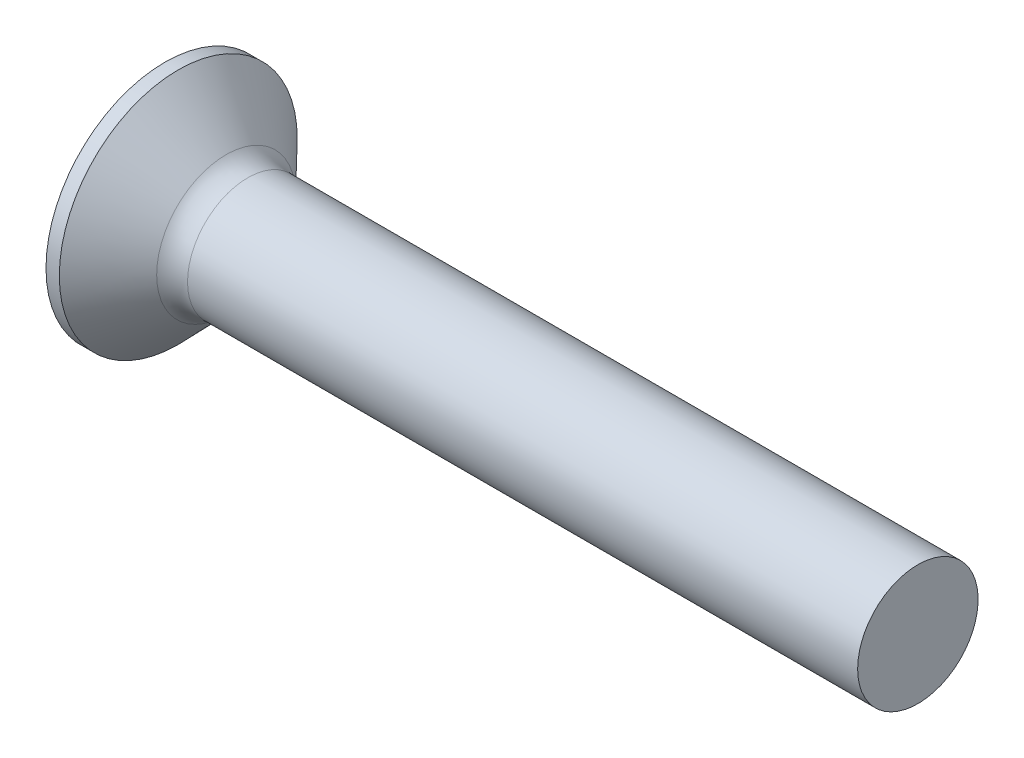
ISO-10303-21;
HEADER;
FILE_DESCRIPTION(('STEP AP214'),'2;1');
FILE_NAME('part.step','',(''),(''),'','','');
FILE_SCHEMA(('AUTOMOTIVE_DESIGN { 1 0 10303 214 1 1 1 1 }'));
ENDSEC;
DATA;
#1=APPLICATION_CONTEXT('core data for automotive mechanical design processes');
#2=APPLICATION_PROTOCOL_DEFINITION('international standard','automotive_design',2000,#1);
#3=PRODUCT_CONTEXT('',#1,'mechanical');
#4=PRODUCT('Part','Part','',(#3));
#5=PRODUCT_RELATED_PRODUCT_CATEGORY('part','',(#4));
#6=PRODUCT_DEFINITION_FORMATION('','',#4);
#7=PRODUCT_DEFINITION_CONTEXT('part definition',#1,'design');
#8=PRODUCT_DEFINITION('design','',#6,#7);
#9=PRODUCT_DEFINITION_SHAPE('','',#8);
#10=(LENGTH_UNIT() NAMED_UNIT(*) SI_UNIT(.MILLI.,.METRE.));
#11=(NAMED_UNIT(*) PLANE_ANGLE_UNIT() SI_UNIT($,.RADIAN.));
#12=(NAMED_UNIT(*) SI_UNIT($,.STERADIAN.) SOLID_ANGLE_UNIT());
#13=UNCERTAINTY_MEASURE_WITH_UNIT(LENGTH_MEASURE(1.E-05),#10,'distance_accuracy_value','');
#14=(GEOMETRIC_REPRESENTATION_CONTEXT(3) GLOBAL_UNCERTAINTY_ASSIGNED_CONTEXT((#13)) GLOBAL_UNIT_ASSIGNED_CONTEXT((#10,
#11,#12)) REPRESENTATION_CONTEXT('',''));
#15=CARTESIAN_POINT('',(0.,0.,0.));
#16=DIRECTION('',(0.,0.,1.));
#17=DIRECTION('',(1.,0.,0.));
#18=AXIS2_PLACEMENT_3D('',#15,#16,#17);
#19=CARTESIAN_POINT('',(0.,0.,0.));
#20=DIRECTION('',(1.,0.,0.));
#21=DIRECTION('',(0.,0.,-1.));
#22=AXIS2_PLACEMENT_3D('',#19,#20,#21);
#23=PLANE('',#22);
#24=CARTESIAN_POINT('',(0.,0.,0.));
#25=DIRECTION('',(-1.,0.,0.));
#26=DIRECTION('',(0.,0.,1.));
#27=AXIS2_PLACEMENT_3D('',#24,#25,#26);
#28=CIRCLE('',#27,7.9);
#29=CARTESIAN_POINT('',(0.,0.,7.9));
#30=VERTEX_POINT('',#29);
#31=EDGE_CURVE('E731',#30,#30,#28,.T.);
#32=ORIENTED_EDGE('',*,*,#31,.T.);
#33=EDGE_LOOP('',(#32));
#34=FACE_BOUND('',#33,.T.);
#35=CARTESIAN_POINT('',(0.,0.,0.));
#36=DIRECTION('',(-1.,0.,0.));
#37=DIRECTION('',(0.,0.,1.));
#38=AXIS2_PLACEMENT_3D('',#35,#36,#37);
#39=CIRCLE('',#38,2.1296);
#40=CARTESIAN_POINT('',(0.,-0.967999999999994,-1.8968848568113));
#41=VERTEX_POINT('',#40);
#42=CARTESIAN_POINT('',(0.,-1.89688485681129,-0.968000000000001));
#43=VERTEX_POINT('',#42);
#44=EDGE_CURVE('E633',#41,#43,#39,.T.);
#45=ORIENTED_EDGE('',*,*,#44,.F.);
#46=DIRECTION('',(0.,0.,1.));
#47=VECTOR('',#46,1.);
#48=CARTESIAN_POINT('',(0.,-0.968000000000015,4.4));
#49=LINE('',#48,#47);
#50=CARTESIAN_POINT('',(0.,-0.967999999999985,-4.4));
#51=VERTEX_POINT('',#50);
#52=EDGE_CURVE('E428',#51,#41,#49,.T.);
#53=ORIENTED_EDGE('',*,*,#52,.F.);
#54=DIRECTION('',(0.,-1.,0.));
#55=VECTOR('',#54,1.);
#56=CARTESIAN_POINT('',(0.,0.968000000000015,-4.4));
#57=LINE('',#56,#55);
#58=CARTESIAN_POINT('',(0.,0.968000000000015,-4.4));
#59=VERTEX_POINT('',#58);
#60=EDGE_CURVE('E226',#59,#51,#57,.T.);
#61=ORIENTED_EDGE('',*,*,#60,.F.);
#62=DIRECTION('',(0.,0.,-1.));
#63=VECTOR('',#62,1.);
#64=CARTESIAN_POINT('',(0.,0.967999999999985,4.4));
#65=LINE('',#64,#63);
#66=CARTESIAN_POINT('',(0.,0.968000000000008,-1.89688485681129));
#67=VERTEX_POINT('',#66);
#68=EDGE_CURVE('E438',#67,#59,#65,.T.);
#69=ORIENTED_EDGE('',*,*,#68,.F.);
#70=CARTESIAN_POINT('',(0.,1.89688485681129,-0.968000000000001));
#71=VERTEX_POINT('',#70);
#72=EDGE_CURVE('E631',#71,#67,#39,.T.);
#73=ORIENTED_EDGE('',*,*,#72,.F.);
#74=DIRECTION('',(0.,-1.,0.));
#75=VECTOR('',#74,1.);
#76=CARTESIAN_POINT('',(0.,4.4,-0.968000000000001));
#77=LINE('',#76,#75);
#78=CARTESIAN_POINT('',(0.,4.4,-0.968000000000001));
#79=VERTEX_POINT('',#78);
#80=EDGE_CURVE('E563',#79,#71,#77,.T.);
#81=ORIENTED_EDGE('',*,*,#80,.F.);
#82=DIRECTION('',(0.,0.,-1.));
#83=VECTOR('',#82,1.);
#84=CARTESIAN_POINT('',(0.,4.4,-0.968000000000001));
#85=LINE('',#84,#83);
#86=CARTESIAN_POINT('',(0.,4.4,0.967999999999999));
#87=VERTEX_POINT('',#86);
#88=EDGE_CURVE('E660',#87,#79,#85,.T.);
#89=ORIENTED_EDGE('',*,*,#88,.F.);
#90=DIRECTION('',(0.,1.,0.));
#91=VECTOR('',#90,1.);
#92=CARTESIAN_POINT('',(0.,4.4,0.967999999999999));
#93=LINE('',#92,#91);
#94=CARTESIAN_POINT('',(0.,1.89688485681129,0.968000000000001));
#95=VERTEX_POINT('',#94);
#96=EDGE_CURVE('E77',#95,#87,#93,.T.);
#97=ORIENTED_EDGE('',*,*,#96,.F.);
#98=CARTESIAN_POINT('',(0.,0.967999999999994,1.8968848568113));
#99=VERTEX_POINT('',#98);
#100=EDGE_CURVE('E628',#99,#95,#39,.T.);
#101=ORIENTED_EDGE('',*,*,#100,.F.);
#102=CARTESIAN_POINT('',(0.,0.967999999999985,4.4));
#103=VERTEX_POINT('',#102);
#104=EDGE_CURVE('E426',#103,#99,#65,.T.);
#105=ORIENTED_EDGE('',*,*,#104,.F.);
#106=DIRECTION('',(0.,1.,0.));
#107=VECTOR('',#106,1.);
#108=CARTESIAN_POINT('',(0.,0.967999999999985,4.4));
#109=LINE('',#108,#107);
#110=CARTESIAN_POINT('',(0.,-0.968000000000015,4.4));
#111=VERTEX_POINT('',#110);
#112=EDGE_CURVE('E358',#111,#103,#109,.T.);
#113=ORIENTED_EDGE('',*,*,#112,.F.);
#114=CARTESIAN_POINT('',(0.,-0.968000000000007,1.89688485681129));
#115=VERTEX_POINT('',#114);
#116=EDGE_CURVE('E425',#115,#111,#49,.T.);
#117=ORIENTED_EDGE('',*,*,#116,.F.);
#118=CARTESIAN_POINT('',(0.,-1.89688485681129,0.968000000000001));
#119=VERTEX_POINT('',#118);
#120=EDGE_CURVE('E606',#119,#115,#39,.T.);
#121=ORIENTED_EDGE('',*,*,#120,.F.);
#122=CARTESIAN_POINT('',(0.,-4.4,0.968000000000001));
#123=VERTEX_POINT('',#122);
#124=EDGE_CURVE('E644',#123,#119,#93,.T.);
#125=ORIENTED_EDGE('',*,*,#124,.F.);
#126=DIRECTION('',(0.,0.,1.));
#127=VECTOR('',#126,1.);
#128=CARTESIAN_POINT('',(0.,-4.4,-0.968));
#129=LINE('',#128,#127);
#130=CARTESIAN_POINT('',(0.,-4.4,-0.968));
#131=VERTEX_POINT('',#130);
#132=EDGE_CURVE('E556',#131,#123,#129,.T.);
#133=ORIENTED_EDGE('',*,*,#132,.F.);
#134=EDGE_CURVE('E560',#43,#131,#77,.T.);
#135=ORIENTED_EDGE('',*,*,#134,.F.);
#136=EDGE_LOOP('',(#45,#53,#61,#69,#73,#81,#89,#97,#101,#105,#113,#117,#121,#125,#133,#135));
#137=FACE_BOUND('',#136,.T.);
#138=ADVANCED_FACE('F51',(#34,#137),#23,.F.);
#139=CARTESIAN_POINT('',(4.96,-1.92703563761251,0.967999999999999));
#140=DIRECTION('',(0.,0.,-1.));
#141=DIRECTION('',(-1.,0.,0.));
#142=AXIS2_PLACEMENT_3D('',#139,#140,#141);
#143=PLANE('',#142);
#144=ORIENTED_EDGE('',*,*,#124,.T.);
#145=CARTESIAN_POINT('',(-0.000200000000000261,-1.89690055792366,0.968000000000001));
#146=CARTESIAN_POINT('',(0.661346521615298,-1.84494348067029,0.968));
#147=CARTESIAN_POINT('',(1.32286268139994,-1.79258954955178,0.968));
#148=CARTESIAN_POINT('',(2.645801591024,-1.68673670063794,0.968));
#149=CARTESIAN_POINT('',(3.30722434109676,-1.63323778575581,0.968));
#150=CARTESIAN_POINT('',(4.13386292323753,-1.56543399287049,0.968));
#151=CARTESIAN_POINT('',(4.2991362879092,-1.55183064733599,0.968));
#152=CARTESIAN_POINT('',(4.62967464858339,-1.5245214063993,0.968));
#153=CARTESIAN_POINT('',(4.79493964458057,-1.5108155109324,0.967999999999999));
#154=CARTESIAN_POINT('',(4.9602,-1.49705380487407,0.967999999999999));
#155=B_SPLINE_CURVE_WITH_KNOTS('',3,(#145,#146,#147,#148,#149,#150,#151,#152,#153,#154),
.UNSPECIFIED.,.F.,.F.,(4,2,2,2,4),(0.,1.99075231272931,3.98149956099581,4.47899628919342,
4.97649333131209),.UNSPECIFIED.);
#156=CARTESIAN_POINT('',(4.96,-1.49707045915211,0.967999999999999));
#157=VERTEX_POINT('',#156);
#158=EDGE_CURVE('E333',#119,#157,#155,.T.);
#159=ORIENTED_EDGE('',*,*,#158,.T.);
#160=DIRECTION('',(0.,-1.,0.));
#161=VECTOR('',#160,1.);
#162=CARTESIAN_POINT('',(4.96,1.92703563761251,0.967999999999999));
#163=LINE('',#162,#161);
#164=CARTESIAN_POINT('',(4.96,-1.92703563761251,0.967999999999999));
#165=VERTEX_POINT('',#164);
#166=EDGE_CURVE('E536',#157,#165,#163,.T.);
#167=ORIENTED_EDGE('',*,*,#166,.T.);
#168=DIRECTION('',(0.894934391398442,0.446197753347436,0.));
#169=VECTOR('',#168,1.);
#170=CARTESIAN_POINT('',(0.,-4.4,0.968000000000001));
#171=LINE('',#170,#169);
#172=EDGE_CURVE('E554',#123,#165,#171,.T.);
#173=ORIENTED_EDGE('',*,*,#172,.F.);
#174=EDGE_LOOP('',(#144,#159,#167,#173));
#175=FACE_BOUND('',#174,.T.);
#176=ADVANCED_FACE('F183',(#175),#143,.T.);
#177=CARTESIAN_POINT('',(4.96,1.92703563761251,0.967999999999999));
#178=VERTEX_POINT('',#177);
#179=CARTESIAN_POINT('',(4.96,1.49707045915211,0.967999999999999));
#180=VERTEX_POINT('',#179);
#181=EDGE_CURVE('E533',#178,#180,#163,.T.);
#182=ORIENTED_EDGE('',*,*,#181,.T.);
#183=CARTESIAN_POINT('',(4.9602,1.49705380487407,0.967999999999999));
#184=CARTESIAN_POINT('',(4.40661279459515,1.54313650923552,0.967999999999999));
#185=CARTESIAN_POINT('',(3.85297670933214,1.58862714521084,0.968));
#186=CARTESIAN_POINT('',(2.74562679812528,1.67864116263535,0.968));
#187=CARTESIAN_POINT('',(2.1919129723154,1.72316454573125,0.968));
#188=CARTESIAN_POINT('',(1.36512147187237,1.78908208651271,0.968));
#189=CARTESIAN_POINT('',(1.09206635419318,1.81076014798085,0.968));
#190=CARTESIAN_POINT('',(0.54594277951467,1.85395051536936,0.968));
#191=CARTESIAN_POINT('',(0.272874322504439,1.87546282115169,0.968));
#192=CARTESIAN_POINT('',(-0.000200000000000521,1.89690055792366,0.968000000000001));
#193=B_SPLINE_CURVE_WITH_KNOTS('',3,(#183,#184,#185,#186,#187,#188,#189,#190,#191,#192),
.UNSPECIFIED.,.F.,.F.,(4,2,2,2,4),(0.,1.66650495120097,3.33300706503,4.15474989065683,
4.97649340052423),.UNSPECIFIED.);
#194=EDGE_CURVE('E332',#180,#95,#193,.T.);
#195=ORIENTED_EDGE('',*,*,#194,.T.);
#196=ORIENTED_EDGE('',*,*,#96,.T.);
#197=DIRECTION('',(0.894934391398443,-0.446197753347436,0.));
#198=VECTOR('',#197,1.);
#199=CARTESIAN_POINT('',(0.,4.4,0.967999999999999));
#200=LINE('',#199,#198);
#201=EDGE_CURVE('E594',#87,#178,#200,.T.);
#202=ORIENTED_EDGE('',*,*,#201,.T.);
#203=EDGE_LOOP('',(#182,#195,#196,#202));
#204=FACE_BOUND('',#203,.T.);
#205=ADVANCED_FACE('F188',(#204),#143,.T.);
#206=CARTESIAN_POINT('',(4.96,1.92703563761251,-0.968000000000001));
#207=DIRECTION('',(0.,0.,1.));
#208=DIRECTION('',(0.,-1.,0.));
#209=AXIS2_PLACEMENT_3D('',#206,#207,#208);
#210=PLANE('',#209);
#211=DIRECTION('',(0.,1.,0.));
#212=VECTOR('',#211,1.);
#213=CARTESIAN_POINT('',(4.96,1.92703563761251,-0.968000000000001));
#214=LINE('',#213,#212);
#215=CARTESIAN_POINT('',(4.96,-1.92703563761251,-0.968000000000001));
#216=VERTEX_POINT('',#215);
#217=CARTESIAN_POINT('',(4.96,-1.49707045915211,-0.968000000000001));
#218=VERTEX_POINT('',#217);
#219=EDGE_CURVE('E408',#216,#218,#214,.T.);
#220=ORIENTED_EDGE('',*,*,#219,.T.);
#221=CARTESIAN_POINT('',(4.9602,-1.49705380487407,-0.968000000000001));
#222=CARTESIAN_POINT('',(4.40661279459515,-1.54313650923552,-0.968000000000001));
#223=CARTESIAN_POINT('',(3.85297670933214,-1.58862714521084,-0.968000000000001));
#224=CARTESIAN_POINT('',(2.74562679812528,-1.67864116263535,-0.968000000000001));
#225=CARTESIAN_POINT('',(2.1919129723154,-1.72316454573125,-0.968000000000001));
#226=CARTESIAN_POINT('',(1.36512147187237,-1.78908208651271,-0.968000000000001));
#227=CARTESIAN_POINT('',(1.09206635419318,-1.81076014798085,-0.968000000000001));
#228=CARTESIAN_POINT('',(0.54594277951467,-1.85395051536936,-0.968000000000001));
#229=CARTESIAN_POINT('',(0.272874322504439,-1.87546282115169,-0.968000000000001));
#230=CARTESIAN_POINT('',(-0.00020000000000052,-1.89690055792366,-0.968000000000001));
#231=B_SPLINE_CURVE_WITH_KNOTS('',3,(#221,#222,#223,#224,#225,#226,#227,#228,#229,#230),
.UNSPECIFIED.,.F.,.F.,(4,2,2,2,4),(0.,1.66650495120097,3.33300706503,4.15474989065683,
4.97649340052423),.UNSPECIFIED.);
#232=EDGE_CURVE('E638',#218,#43,#231,.T.);
#233=ORIENTED_EDGE('',*,*,#232,.T.);
#234=ORIENTED_EDGE('',*,*,#134,.T.);
#235=DIRECTION('',(0.894934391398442,0.446197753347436,0.));
#236=VECTOR('',#235,1.);
#237=CARTESIAN_POINT('',(0.,-4.4,-0.968));
#238=LINE('',#237,#236);
#239=EDGE_CURVE('E561',#131,#216,#238,.T.);
#240=ORIENTED_EDGE('',*,*,#239,.T.);
#241=EDGE_LOOP('',(#220,#233,#234,#240));
#242=FACE_BOUND('',#241,.T.);
#243=ADVANCED_FACE('F338',(#242),#210,.T.);
#244=ORIENTED_EDGE('',*,*,#80,.T.);
#245=CARTESIAN_POINT('',(-0.000200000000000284,1.89690055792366,-0.968000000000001));
#246=CARTESIAN_POINT('',(0.661346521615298,1.84494348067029,-0.968000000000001));
#247=CARTESIAN_POINT('',(1.32286268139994,1.79258954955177,-0.968000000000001));
#248=CARTESIAN_POINT('',(2.645801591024,1.68673670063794,-0.968000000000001));
#249=CARTESIAN_POINT('',(3.30722434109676,1.63323778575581,-0.968000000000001));
#250=CARTESIAN_POINT('',(4.13386292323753,1.56543399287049,-0.968000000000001));
#251=CARTESIAN_POINT('',(4.2991362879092,1.55183064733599,-0.968000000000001));
#252=CARTESIAN_POINT('',(4.62967464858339,1.5245214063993,-0.968000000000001));
#253=CARTESIAN_POINT('',(4.79493964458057,1.5108155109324,-0.968000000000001));
#254=CARTESIAN_POINT('',(4.9602,1.49705380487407,-0.968000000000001));
#255=B_SPLINE_CURVE_WITH_KNOTS('',3,(#245,#246,#247,#248,#249,#250,#251,#252,#253,#254),
.UNSPECIFIED.,.F.,.F.,(4,2,2,2,4),(0.,1.99075231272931,3.98149956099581,4.47899628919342,
4.97649333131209),.UNSPECIFIED.);
#256=CARTESIAN_POINT('',(4.96,1.49707045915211,-0.968000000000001));
#257=VERTEX_POINT('',#256);
#258=EDGE_CURVE('E643',#71,#257,#255,.T.);
#259=ORIENTED_EDGE('',*,*,#258,.T.);
#260=CARTESIAN_POINT('',(4.96,1.92703563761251,-0.968000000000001));
#261=VERTEX_POINT('',#260);
#262=EDGE_CURVE('E537',#257,#261,#214,.T.);
#263=ORIENTED_EDGE('',*,*,#262,.T.);
#264=DIRECTION('',(0.894934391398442,-0.446197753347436,0.));
#265=VECTOR('',#264,1.);
#266=CARTESIAN_POINT('',(0.,4.4,-0.968000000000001));
#267=LINE('',#266,#265);
#268=EDGE_CURVE('E564',#79,#261,#267,.T.);
#269=ORIENTED_EDGE('',*,*,#268,.F.);
#270=EDGE_LOOP('',(#244,#259,#263,#269));
#271=FACE_BOUND('',#270,.T.);
#272=ADVANCED_FACE('F464',(#271),#210,.T.);
#273=CARTESIAN_POINT('',(4.96,1.92703563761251,-0.968000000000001));
#274=DIRECTION('',(-1.,0.,0.));
#275=DIRECTION('',(0.,0.,1.));
#276=AXIS2_PLACEMENT_3D('',#273,#274,#275);
#277=PLANE('',#276);
#278=ORIENTED_EDGE('',*,*,#166,.F.);
#279=CARTESIAN_POINT('',(4.96,0.,0.));
#280=DIRECTION('',(-1.,0.,0.));
#281=DIRECTION('',(0.,0.,1.));
#282=AXIS2_PLACEMENT_3D('',#279,#280,#281);
#283=CIRCLE('',#282,1.78276301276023);
#284=EDGE_CURVE('E618',#218,#157,#283,.T.);
#285=ORIENTED_EDGE('',*,*,#284,.F.);
#286=ORIENTED_EDGE('',*,*,#219,.F.);
#287=DIRECTION('',(0.,0.,-1.));
#288=VECTOR('',#287,1.);
#289=CARTESIAN_POINT('',(4.96,-1.92703563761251,-0.968000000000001));
#290=LINE('',#289,#288);
#291=EDGE_CURVE('E542',#165,#216,#290,.T.);
#292=ORIENTED_EDGE('',*,*,#291,.F.);
#293=EDGE_LOOP('',(#278,#285,#286,#292));
#294=FACE_BOUND('',#293,.T.);
#295=ADVANCED_FACE('F454',(#294),#277,.T.);
#296=DIRECTION('',(0.,0.,-1.));
#297=VECTOR('',#296,1.);
#298=CARTESIAN_POINT('',(4.96,-0.968000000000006,1.92703563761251));
#299=LINE('',#298,#297);
#300=CARTESIAN_POINT('',(4.96,-0.967999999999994,-1.49707045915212));
#301=VERTEX_POINT('',#300);
#302=CARTESIAN_POINT('',(4.96,-0.967999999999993,-1.92703563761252));
#303=VERTEX_POINT('',#302);
#304=EDGE_CURVE('E395',#301,#303,#299,.T.);
#305=ORIENTED_EDGE('',*,*,#304,.F.);
#306=CARTESIAN_POINT('',(4.96,0.968000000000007,-1.49707045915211));
#307=VERTEX_POINT('',#306);
#308=EDGE_CURVE('E608',#307,#301,#283,.T.);
#309=ORIENTED_EDGE('',*,*,#308,.F.);
#310=DIRECTION('',(0.,0.,1.));
#311=VECTOR('',#310,1.);
#312=CARTESIAN_POINT('',(4.96,0.967999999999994,1.92703563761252));
#313=LINE('',#312,#311);
#314=CARTESIAN_POINT('',(4.96,0.968000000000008,-1.92703563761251));
#315=VERTEX_POINT('',#314);
#316=EDGE_CURVE('E402',#315,#307,#313,.T.);
#317=ORIENTED_EDGE('',*,*,#316,.F.);
#318=DIRECTION('',(0.,1.,0.));
#319=VECTOR('',#318,1.);
#320=CARTESIAN_POINT('',(4.96,0.968000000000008,-1.92703563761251));
#321=LINE('',#320,#319);
#322=EDGE_CURVE('E397',#303,#315,#321,.T.);
#323=ORIENTED_EDGE('',*,*,#322,.F.);
#324=EDGE_LOOP('',(#305,#309,#317,#323));
#325=FACE_BOUND('',#324,.T.);
#326=ADVANCED_FACE('F463',(#325),#277,.T.);
#327=ORIENTED_EDGE('',*,*,#262,.F.);
#328=EDGE_CURVE('E600',#180,#257,#283,.T.);
#329=ORIENTED_EDGE('',*,*,#328,.F.);
#330=ORIENTED_EDGE('',*,*,#181,.F.);
#331=DIRECTION('',(0.,0.,1.));
#332=VECTOR('',#331,1.);
#333=CARTESIAN_POINT('',(4.96,1.92703563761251,-0.968000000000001));
#334=LINE('',#333,#332);
#335=EDGE_CURVE('E535',#261,#178,#334,.T.);
#336=ORIENTED_EDGE('',*,*,#335,.F.);
#337=EDGE_LOOP('',(#327,#329,#330,#336));
#338=FACE_BOUND('',#337,.T.);
#339=ADVANCED_FACE('F598',(#338),#277,.T.);
#340=CARTESIAN_POINT('',(4.96,0.967999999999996,1.49707045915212));
#341=VERTEX_POINT('',#340);
#342=CARTESIAN_POINT('',(4.96,0.967999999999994,1.92703563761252));
#343=VERTEX_POINT('',#342);
#344=EDGE_CURVE('E523',#341,#343,#313,.T.);
#345=ORIENTED_EDGE('',*,*,#344,.F.);
#346=CARTESIAN_POINT('',(4.96,-0.968000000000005,1.49707045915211));
#347=VERTEX_POINT('',#346);
#348=EDGE_CURVE('E524',#347,#341,#283,.T.);
#349=ORIENTED_EDGE('',*,*,#348,.F.);
#350=CARTESIAN_POINT('',(4.96,-0.968000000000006,1.92703563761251));
#351=VERTEX_POINT('',#350);
#352=EDGE_CURVE('E55',#351,#347,#299,.T.);
#353=ORIENTED_EDGE('',*,*,#352,.F.);
#354=DIRECTION('',(0.,-1.,0.));
#355=VECTOR('',#354,1.);
#356=CARTESIAN_POINT('',(4.96,0.967999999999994,1.92703563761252));
#357=LINE('',#356,#355);
#358=EDGE_CURVE('E394',#343,#351,#357,.T.);
#359=ORIENTED_EDGE('',*,*,#358,.F.);
#360=EDGE_LOOP('',(#345,#349,#353,#359));
#361=FACE_BOUND('',#360,.T.);
#362=ADVANCED_FACE('F254',(#361),#277,.T.);
#363=CARTESIAN_POINT('',(4.96,-0.967999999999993,-1.92703563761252));
#364=DIRECTION('',(0.,1.,0.));
#365=DIRECTION('',(-1.,0.,0.));
#366=AXIS2_PLACEMENT_3D('',#363,#364,#365);
#367=PLANE('',#366);
#368=ORIENTED_EDGE('',*,*,#52,.T.);
#369=CARTESIAN_POINT('',(-0.000200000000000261,-0.967999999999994,-1.89690055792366));
#370=CARTESIAN_POINT('',(0.661346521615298,-0.967999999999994,-1.84494348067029));
#371=CARTESIAN_POINT('',(1.32286268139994,-0.967999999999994,-1.79258954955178));
#372=CARTESIAN_POINT('',(2.645801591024,-0.967999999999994,-1.68673670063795));
#373=CARTESIAN_POINT('',(3.30722434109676,-0.967999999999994,-1.63323778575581));
#374=CARTESIAN_POINT('',(4.13386292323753,-0.967999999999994,-1.5654339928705));
#375=CARTESIAN_POINT('',(4.2991362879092,-0.967999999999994,-1.551830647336));
#376=CARTESIAN_POINT('',(4.62967464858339,-0.967999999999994,-1.5245214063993));
#377=CARTESIAN_POINT('',(4.79493964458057,-0.967999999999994,-1.5108155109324));
#378=CARTESIAN_POINT('',(4.9602,-0.967999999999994,-1.49705380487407));
#379=B_SPLINE_CURVE_WITH_KNOTS('',3,(#369,#370,#371,#372,#373,#374,#375,#376,#377,#378),
.UNSPECIFIED.,.F.,.F.,(4,2,2,2,4),(0.,1.99075231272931,3.98149956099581,4.47899628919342,
4.97649333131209),.UNSPECIFIED.);
#380=EDGE_CURVE('E639',#41,#301,#379,.T.);
#381=ORIENTED_EDGE('',*,*,#380,.T.);
#382=ORIENTED_EDGE('',*,*,#304,.T.);
#383=DIRECTION('',(0.894934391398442,0.,0.446197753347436));
#384=VECTOR('',#383,1.);
#385=CARTESIAN_POINT('',(0.,-0.967999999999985,-4.4));
#386=LINE('',#385,#384);
#387=EDGE_CURVE('E439',#51,#303,#386,.T.);
#388=ORIENTED_EDGE('',*,*,#387,.F.);
#389=EDGE_LOOP('',(#368,#381,#382,#388));
#390=FACE_BOUND('',#389,.T.);
#391=ADVANCED_FACE('F244',(#390),#367,.T.);
#392=CARTESIAN_POINT('',(4.96,0.967999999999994,1.92703563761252));
#393=DIRECTION('',(0.,-1.,0.));
#394=DIRECTION('',(0.,0.,-1.));
#395=AXIS2_PLACEMENT_3D('',#392,#393,#394);
#396=PLANE('',#395);
#397=ORIENTED_EDGE('',*,*,#316,.T.);
#398=CARTESIAN_POINT('',(4.9602,0.968000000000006,-1.49705380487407));
#399=CARTESIAN_POINT('',(4.40661279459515,0.968000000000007,-1.54313650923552));
#400=CARTESIAN_POINT('',(3.85297670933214,0.968000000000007,-1.58862714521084));
#401=CARTESIAN_POINT('',(2.74562679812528,0.968000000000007,-1.67864116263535));
#402=CARTESIAN_POINT('',(2.1919129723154,0.968000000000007,-1.72316454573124));
#403=CARTESIAN_POINT('',(1.36512147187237,0.968000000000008,-1.7890820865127));
#404=CARTESIAN_POINT('',(1.09206635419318,0.968000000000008,-1.81076014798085));
#405=CARTESIAN_POINT('',(0.54594277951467,0.968000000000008,-1.85395051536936));
#406=CARTESIAN_POINT('',(0.272874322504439,0.968000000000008,-1.87546282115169));
#407=CARTESIAN_POINT('',(-0.000200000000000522,0.968000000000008,-1.89690055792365));
#408=B_SPLINE_CURVE_WITH_KNOTS('',3,(#398,#399,#400,#401,#402,#403,#404,#405,#406,#407),
.UNSPECIFIED.,.F.,.F.,(4,2,2,2,4),(0.,1.66650495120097,3.33300706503,4.15474989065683,
4.97649340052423),.UNSPECIFIED.);
#409=EDGE_CURVE('E280',#307,#67,#408,.T.);
#410=ORIENTED_EDGE('',*,*,#409,.T.);
#411=ORIENTED_EDGE('',*,*,#68,.T.);
#412=DIRECTION('',(0.894934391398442,0.,0.446197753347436));
#413=VECTOR('',#412,1.);
#414=CARTESIAN_POINT('',(0.,0.968000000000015,-4.4));
#415=LINE('',#414,#413);
#416=EDGE_CURVE('E669',#59,#315,#415,.T.);
#417=ORIENTED_EDGE('',*,*,#416,.T.);
#418=EDGE_LOOP('',(#397,#410,#411,#417));
#419=FACE_BOUND('',#418,.T.);
#420=ADVANCED_FACE('F253',(#419),#396,.T.);
#421=ORIENTED_EDGE('',*,*,#352,.T.);
#422=CARTESIAN_POINT('',(4.9602,-0.968000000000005,1.49705380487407));
#423=CARTESIAN_POINT('',(4.40661279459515,-0.968000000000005,1.54313650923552));
#424=CARTESIAN_POINT('',(3.85297670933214,-0.968000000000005,1.58862714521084));
#425=CARTESIAN_POINT('',(2.74562679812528,-0.968000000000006,1.67864116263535));
#426=CARTESIAN_POINT('',(2.1919129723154,-0.968000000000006,1.72316454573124));
#427=CARTESIAN_POINT('',(1.36512147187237,-0.968000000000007,1.78908208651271));
#428=CARTESIAN_POINT('',(1.09206635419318,-0.968000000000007,1.81076014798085));
#429=CARTESIAN_POINT('',(0.54594277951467,-0.968000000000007,1.85395051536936));
#430=CARTESIAN_POINT('',(0.272874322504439,-0.968000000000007,1.87546282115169));
#431=CARTESIAN_POINT('',(-0.000200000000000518,-0.968000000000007,1.89690055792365));
#432=B_SPLINE_CURVE_WITH_KNOTS('',3,(#422,#423,#424,#425,#426,#427,#428,#429,#430,#431),
.UNSPECIFIED.,.F.,.F.,(4,2,2,2,4),(0.,1.66650495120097,3.33300706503,4.15474989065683,
4.97649340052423),.UNSPECIFIED.);
#433=EDGE_CURVE('E278',#347,#115,#432,.T.);
#434=ORIENTED_EDGE('',*,*,#433,.T.);
#435=ORIENTED_EDGE('',*,*,#116,.T.);
#436=DIRECTION('',(0.894934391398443,0.,-0.446197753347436));
#437=VECTOR('',#436,1.);
#438=CARTESIAN_POINT('',(0.,-0.968000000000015,4.4));
#439=LINE('',#438,#437);
#440=EDGE_CURVE('E363',#111,#351,#439,.T.);
#441=ORIENTED_EDGE('',*,*,#440,.T.);
#442=EDGE_LOOP('',(#421,#434,#435,#441));
#443=FACE_BOUND('',#442,.T.);
#444=ADVANCED_FACE('F256',(#443),#367,.T.);
#445=ORIENTED_EDGE('',*,*,#104,.T.);
#446=CARTESIAN_POINT('',(-0.000200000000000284,0.967999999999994,1.89690055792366));
#447=CARTESIAN_POINT('',(0.661346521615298,0.967999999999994,1.8449434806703));
#448=CARTESIAN_POINT('',(1.32286268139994,0.967999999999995,1.79258954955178));
#449=CARTESIAN_POINT('',(2.645801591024,0.967999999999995,1.68673670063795));
#450=CARTESIAN_POINT('',(3.30722434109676,0.967999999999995,1.63323778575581));
#451=CARTESIAN_POINT('',(4.13386292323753,0.967999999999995,1.56543399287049));
#452=CARTESIAN_POINT('',(4.2991362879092,0.967999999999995,1.551830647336));
#453=CARTESIAN_POINT('',(4.62967464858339,0.967999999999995,1.5245214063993));
#454=CARTESIAN_POINT('',(4.79493964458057,0.967999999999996,1.5108155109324));
#455=CARTESIAN_POINT('',(4.9602,0.967999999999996,1.49705380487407));
#456=B_SPLINE_CURVE_WITH_KNOTS('',3,(#446,#447,#448,#449,#450,#451,#452,#453,#454,#455),
.UNSPECIFIED.,.F.,.F.,(4,2,2,2,4),(0.,1.99075231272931,3.98149956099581,4.47899628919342,
4.97649333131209),.UNSPECIFIED.);
#457=EDGE_CURVE('E12',#99,#341,#456,.T.);
#458=ORIENTED_EDGE('',*,*,#457,.T.);
#459=ORIENTED_EDGE('',*,*,#344,.T.);
#460=DIRECTION('',(0.894934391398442,0.,-0.446197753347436));
#461=VECTOR('',#460,1.);
#462=CARTESIAN_POINT('',(0.,0.967999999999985,4.4));
#463=LINE('',#462,#461);
#464=EDGE_CURVE('E668',#103,#343,#463,.T.);
#465=ORIENTED_EDGE('',*,*,#464,.F.);
#466=EDGE_LOOP('',(#445,#458,#459,#465));
#467=FACE_BOUND('',#466,.T.);
#468=ADVANCED_FACE('F624',(#467),#396,.T.);
#469=CARTESIAN_POINT('',(0.,0.,0.));
#470=DIRECTION('',(-1.,0.,0.));
#471=DIRECTION('',(0.,0.,1.));
#472=AXIS2_PLACEMENT_3D('',#469,#470,#471);
#473=CYLINDRICAL_SURFACE('',#472,7.9);
#474=ORIENTED_EDGE('',*,*,#31,.F.);
#475=EDGE_LOOP('',(#474));
#476=FACE_BOUND('',#475,.T.);
#477=CARTESIAN_POINT('',(0.883813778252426,0.,0.));
#478=DIRECTION('',(-1.,0.,0.));
#479=DIRECTION('',(0.,0.,1.));
#480=AXIS2_PLACEMENT_3D('',#477,#478,#479);
#481=CIRCLE('',#480,7.9);
#482=CARTESIAN_POINT('',(0.883813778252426,0.,7.9));
#483=VERTEX_POINT('',#482);
#484=EDGE_CURVE('E667',#483,#483,#481,.T.);
#485=ORIENTED_EDGE('',*,*,#484,.T.);
#486=EDGE_LOOP('',(#485));
#487=FACE_BOUND('',#486,.T.);
#488=ADVANCED_FACE('F195',(#476,#487),#473,.T.);
#489=CARTESIAN_POINT('',(4.65,0.,0.));
#490=DIRECTION('',(-1.,0.,0.));
#491=DIRECTION('',(0.,0.,1.));
#492=AXIS2_PLACEMENT_3D('',#489,#490,#491);
#493=CONICAL_SURFACE('',#492,4.,0.802851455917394);
#494=CARTESIAN_POINT('',(4.06027003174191,0.,0.));
#495=DIRECTION('',(-1.,0.,0.));
#496=DIRECTION('',(0.,0.,1.));
#497=AXIS2_PLACEMENT_3D('',#494,#495,#496);
#498=CIRCLE('',#497,4.61068325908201);
#499=CARTESIAN_POINT('',(4.06027003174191,0.,4.61068325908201));
#500=VERTEX_POINT('',#499);
#501=EDGE_CURVE('E729',#500,#500,#498,.T.);
#502=ORIENTED_EDGE('',*,*,#501,.T.);
#503=EDGE_LOOP('',(#502));
#504=FACE_BOUND('',#503,.T.);
#505=ORIENTED_EDGE('',*,*,#484,.F.);
#506=EDGE_LOOP('',(#505));
#507=FACE_BOUND('',#506,.T.);
#508=ADVANCED_FACE('F740',(#504,#507),#493,.T.);
#509=CARTESIAN_POINT('',(0.,0.,0.));
#510=DIRECTION('',(-1.,0.,0.));
#511=DIRECTION('',(0.,0.,1.));
#512=AXIS2_PLACEMENT_3D('',#509,#510,#511);
#513=CYLINDRICAL_SURFACE('',#512,4.);
#514=CARTESIAN_POINT('',(5.49894963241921,0.,0.));
#515=DIRECTION('',(-1.,0.,0.));
#516=DIRECTION('',(0.,0.,1.));
#517=AXIS2_PLACEMENT_3D('',#514,#515,#516);
#518=CIRCLE('',#517,4.);
#519=CARTESIAN_POINT('',(5.49894963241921,0.,4.));
#520=VERTEX_POINT('',#519);
#521=EDGE_CURVE('E61',#520,#520,#518,.F.);
#522=ORIENTED_EDGE('',*,*,#521,.T.);
#523=EDGE_LOOP('',(#522));
#524=FACE_BOUND('',#523,.T.);
#525=CARTESIAN_POINT('',(50.,0.,0.));
#526=DIRECTION('',(-1.,0.,0.));
#527=DIRECTION('',(0.,0.,1.));
#528=AXIS2_PLACEMENT_3D('',#525,#526,#527);
#529=CIRCLE('',#528,4.);
#530=CARTESIAN_POINT('',(50.,0.,4.));
#531=VERTEX_POINT('',#530);
#532=EDGE_CURVE('E661',#531,#531,#529,.T.);
#533=ORIENTED_EDGE('',*,*,#532,.T.);
#534=EDGE_LOOP('',(#533));
#535=FACE_BOUND('',#534,.T.);
#536=ADVANCED_FACE('F722',(#524,#535),#513,.T.);
#537=CARTESIAN_POINT('',(50.,4.,0.));
#538=DIRECTION('',(-1.,0.,0.));
#539=DIRECTION('',(0.,0.,1.));
#540=AXIS2_PLACEMENT_3D('',#537,#538,#539);
#541=PLANE('',#540);
#542=ORIENTED_EDGE('',*,*,#532,.F.);
#543=EDGE_LOOP('',(#542));
#544=FACE_BOUND('',#543,.T.);
#545=ADVANCED_FACE('F468',(#544),#541,.F.);
#546=CARTESIAN_POINT('',(5.49894963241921,0.,0.));
#547=DIRECTION('',(-1.,0.,0.));
#548=DIRECTION('',(0.,0.,1.));
#549=AXIS2_PLACEMENT_3D('',#546,#547,#548);
#550=TOROIDAL_SURFACE('',#549,6.,2.);
#551=ORIENTED_EDGE('',*,*,#521,.F.);
#552=EDGE_LOOP('',(#551));
#553=FACE_BOUND('',#552,.T.);
#554=ORIENTED_EDGE('',*,*,#501,.F.);
#555=EDGE_LOOP('',(#554));
#556=FACE_BOUND('',#555,.T.);
#557=ADVANCED_FACE('F53',(#553,#556),#550,.F.);
#558=CARTESIAN_POINT('',(4.96,-1.92703563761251,-0.968000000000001));
#559=DIRECTION('',(-0.446197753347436,0.894934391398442,0.));
#560=DIRECTION('',(-0.894934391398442,-0.446197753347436,0.));
#561=AXIS2_PLACEMENT_3D('',#558,#559,#560);
#562=PLANE('',#561);
#563=ORIENTED_EDGE('',*,*,#239,.F.);
#564=ORIENTED_EDGE('',*,*,#132,.T.);
#565=ORIENTED_EDGE('',*,*,#172,.T.);
#566=ORIENTED_EDGE('',*,*,#291,.T.);
#567=EDGE_LOOP('',(#563,#564,#565,#566));
#568=FACE_BOUND('',#567,.T.);
#569=ADVANCED_FACE('F336',(#568),#562,.T.);
#570=CARTESIAN_POINT('',(4.96,1.92703563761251,0.967999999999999));
#571=DIRECTION('',(-0.446197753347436,-0.894934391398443,0.));
#572=DIRECTION('',(0.894934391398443,-0.446197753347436,0.));
#573=AXIS2_PLACEMENT_3D('',#570,#571,#572);
#574=PLANE('',#573);
#575=ORIENTED_EDGE('',*,*,#201,.F.);
#576=ORIENTED_EDGE('',*,*,#88,.T.);
#577=ORIENTED_EDGE('',*,*,#268,.T.);
#578=ORIENTED_EDGE('',*,*,#335,.T.);
#579=EDGE_LOOP('',(#575,#576,#577,#578));
#580=FACE_BOUND('',#579,.T.);
#581=ADVANCED_FACE('F466',(#580),#574,.T.);
#582=CARTESIAN_POINT('',(4.96,0.968000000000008,-1.92703563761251));
#583=DIRECTION('',(-0.446197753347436,0.,0.894934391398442));
#584=DIRECTION('',(-0.894934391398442,0.,-0.446197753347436));
#585=AXIS2_PLACEMENT_3D('',#582,#583,#584);
#586=PLANE('',#585);
#587=ORIENTED_EDGE('',*,*,#416,.F.);
#588=ORIENTED_EDGE('',*,*,#60,.T.);
#589=ORIENTED_EDGE('',*,*,#387,.T.);
#590=ORIENTED_EDGE('',*,*,#322,.T.);
#591=EDGE_LOOP('',(#587,#588,#589,#590));
#592=FACE_BOUND('',#591,.T.);
#593=ADVANCED_FACE('F257',(#592),#586,.T.);
#594=CARTESIAN_POINT('',(4.96,-0.968000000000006,1.92703563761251));
#595=DIRECTION('',(-0.446197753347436,0.,-0.894934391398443));
#596=DIRECTION('',(0.894934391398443,0.,-0.446197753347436));
#597=AXIS2_PLACEMENT_3D('',#594,#595,#596);
#598=PLANE('',#597);
#599=ORIENTED_EDGE('',*,*,#440,.F.);
#600=ORIENTED_EDGE('',*,*,#112,.T.);
#601=ORIENTED_EDGE('',*,*,#464,.T.);
#602=ORIENTED_EDGE('',*,*,#358,.T.);
#603=EDGE_LOOP('',(#599,#600,#601,#602));
#604=FACE_BOUND('',#603,.T.);
#605=ADVANCED_FACE('F365',(#604),#598,.T.);
#606=CARTESIAN_POINT('',(4.96,0.,0.));
#607=DIRECTION('',(-1.,0.,0.));
#608=DIRECTION('',(0.,0.,1.));
#609=AXIS2_PLACEMENT_3D('',#606,#607,#608);
#610=CONICAL_SURFACE('',#609,1.78276301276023,0.0698131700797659);
#611=ORIENTED_EDGE('',*,*,#120,.T.);
#612=ORIENTED_EDGE('',*,*,#433,.F.);
#613=EDGE_CURVE('E621',#157,#347,#283,.T.);
#614=ORIENTED_EDGE('',*,*,#613,.F.);
#615=ORIENTED_EDGE('',*,*,#158,.F.);
#616=EDGE_LOOP('',(#611,#612,#614,#615));
#617=FACE_BOUND('',#616,.T.);
#618=ADVANCED_FACE('F181',(#617),#610,.F.);
#619=EDGE_CURVE('E69',#341,#180,#283,.T.);
#620=ORIENTED_EDGE('',*,*,#619,.F.);
#621=ORIENTED_EDGE('',*,*,#457,.F.);
#622=ORIENTED_EDGE('',*,*,#100,.T.);
#623=ORIENTED_EDGE('',*,*,#194,.F.);
#624=EDGE_LOOP('',(#620,#621,#622,#623));
#625=FACE_BOUND('',#624,.T.);
#626=ADVANCED_FACE('F627',(#625),#610,.F.);
#627=EDGE_CURVE('E615',#301,#218,#283,.T.);
#628=ORIENTED_EDGE('',*,*,#627,.F.);
#629=ORIENTED_EDGE('',*,*,#380,.F.);
#630=ORIENTED_EDGE('',*,*,#44,.T.);
#631=ORIENTED_EDGE('',*,*,#232,.F.);
#632=EDGE_LOOP('',(#628,#629,#630,#631));
#633=FACE_BOUND('',#632,.T.);
#634=ADVANCED_FACE('F178',(#633),#610,.F.);
#635=ORIENTED_EDGE('',*,*,#72,.T.);
#636=ORIENTED_EDGE('',*,*,#409,.F.);
#637=EDGE_CURVE('E604',#257,#307,#283,.T.);
#638=ORIENTED_EDGE('',*,*,#637,.F.);
#639=ORIENTED_EDGE('',*,*,#258,.F.);
#640=EDGE_LOOP('',(#635,#636,#638,#639));
#641=FACE_BOUND('',#640,.T.);
#642=ADVANCED_FACE('F172',(#641),#610,.F.);
#643=CARTESIAN_POINT('',(5.5392548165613,0.,0.));
#644=DIRECTION('',(-1.,0.,0.));
#645=DIRECTION('',(0.,0.,1.));
#646=AXIS2_PLACEMENT_3D('',#643,#644,#645);
#647=CONICAL_SURFACE('',#646,0.,1.25663706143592);
#648=ORIENTED_EDGE('',*,*,#619,.T.);
#649=ORIENTED_EDGE('',*,*,#328,.T.);
#650=ORIENTED_EDGE('',*,*,#637,.T.);
#651=ORIENTED_EDGE('',*,*,#308,.T.);
#652=ORIENTED_EDGE('',*,*,#627,.T.);
#653=ORIENTED_EDGE('',*,*,#284,.T.);
#654=ORIENTED_EDGE('',*,*,#613,.T.);
#655=ORIENTED_EDGE('',*,*,#348,.T.);
#656=EDGE_LOOP('',(#648,#649,#650,#651,#652,#653,#654,#655));
#657=FACE_BOUND('',#656,.T.);
#658=CARTESIAN_POINT('',(5.5392548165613,0.,0.));
#659=VERTEX_POINT('',#658);
#660=VERTEX_LOOP('',#659);
#661=FACE_BOUND('',#660,.T.);
#662=ADVANCED_FACE('F170',(#657,#661),#647,.F.);
#663=CLOSED_SHELL('',(#138,#176,#205,#243,#272,#295,#326,#339,#362,#391,#420,#444,#468,#488,
#508,#536,#545,#557,#569,#581,#593,#605,#618,#626,#634,#642,#662));
#664=MANIFOLD_SOLID_BREP('B2',#663);
#665=ADVANCED_BREP_SHAPE_REPRESENTATION('',(#18,#664),#14);
#666=SHAPE_DEFINITION_REPRESENTATION(#9,#665);
ENDSEC;
END-ISO-10303-21;
